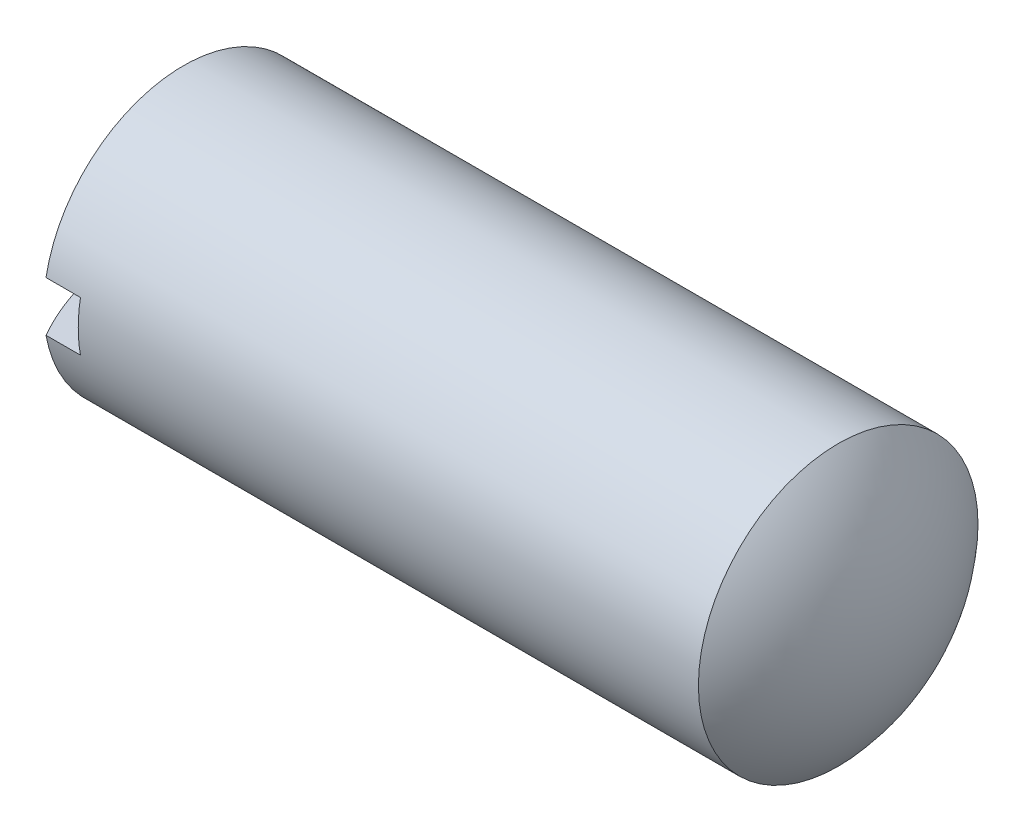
ISO-10303-21;
HEADER;
FILE_DESCRIPTION(('STEP AP214'),'2;1');
FILE_NAME('part.step','',(''),(''),'','','');
FILE_SCHEMA(('AUTOMOTIVE_DESIGN { 1 0 10303 214 1 1 1 1 }'));
ENDSEC;
DATA;
#1=APPLICATION_CONTEXT('core data for automotive mechanical design processes');
#2=APPLICATION_PROTOCOL_DEFINITION('international standard','automotive_design',2000,#1);
#3=PRODUCT_CONTEXT('',#1,'mechanical');
#4=PRODUCT('Part','Part','',(#3));
#5=PRODUCT_RELATED_PRODUCT_CATEGORY('part','',(#4));
#6=PRODUCT_DEFINITION_FORMATION('','',#4);
#7=PRODUCT_DEFINITION_CONTEXT('part definition',#1,'design');
#8=PRODUCT_DEFINITION('design','',#6,#7);
#9=PRODUCT_DEFINITION_SHAPE('','',#8);
#10=(LENGTH_UNIT() NAMED_UNIT(*) SI_UNIT(.MILLI.,.METRE.));
#11=(NAMED_UNIT(*) PLANE_ANGLE_UNIT() SI_UNIT($,.RADIAN.));
#12=(NAMED_UNIT(*) SI_UNIT($,.STERADIAN.) SOLID_ANGLE_UNIT());
#13=UNCERTAINTY_MEASURE_WITH_UNIT(LENGTH_MEASURE(1.E-05),#10,'distance_accuracy_value','');
#14=(GEOMETRIC_REPRESENTATION_CONTEXT(3) GLOBAL_UNCERTAINTY_ASSIGNED_CONTEXT((#13)) GLOBAL_UNIT_ASSIGNED_CONTEXT((#10,
#11,#12)) REPRESENTATION_CONTEXT('',''));
#15=CARTESIAN_POINT('',(0.,0.,0.));
#16=DIRECTION('',(0.,0.,1.));
#17=DIRECTION('',(1.,0.,0.));
#18=AXIS2_PLACEMENT_3D('',#15,#16,#17);
#19=CARTESIAN_POINT('',(19.05,0.,0.));
#20=DIRECTION('',(-1.,0.,0.));
#21=DIRECTION('',(0.,1.,0.));
#22=AXIS2_PLACEMENT_3D('',#19,#20,#21);
#23=SPHERICAL_SURFACE('',#22,19.05);
#24=CARTESIAN_POINT('',(19.05,1.7018,0.));
#25=DIRECTION('',(0.,-1.,0.));
#26=DIRECTION('',(0.,0.,-1.));
#27=AXIS2_PLACEMENT_3D('',#24,#25,#26);
#28=CIRCLE('',#27,18.9738340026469);
#29=CARTESIAN_POINT('',(2.55221605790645,1.7018,9.37173952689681));
#30=VERTEX_POINT('',#29);
#31=CARTESIAN_POINT('',(2.55221605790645,1.7018,-9.37173952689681));
#32=VERTEX_POINT('',#31);
#33=EDGE_CURVE('E94',#30,#32,#28,.T.);
#34=ORIENTED_EDGE('',*,*,#33,.F.);
#35=CARTESIAN_POINT('',(2.55221605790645,0.,0.));
#36=DIRECTION('',(-1.,0.,0.));
#37=DIRECTION('',(0.,0.,1.));
#38=AXIS2_PLACEMENT_3D('',#35,#36,#37);
#39=CIRCLE('',#38,9.525);
#40=EDGE_CURVE('E86',#30,#32,#39,.T.);
#41=ORIENTED_EDGE('',*,*,#40,.T.);
#42=EDGE_LOOP('',(#34,#41));
#43=FACE_BOUND('',#42,.T.);
#44=ADVANCED_FACE('F33',(#43),#23,.T.);
#45=CARTESIAN_POINT('',(19.05,-1.7018,0.));
#46=DIRECTION('',(0.,1.,0.));
#47=DIRECTION('',(0.,0.,1.));
#48=AXIS2_PLACEMENT_3D('',#45,#46,#47);
#49=CIRCLE('',#48,18.9738340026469);
#50=CARTESIAN_POINT('',(2.55221605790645,-1.7018,-9.37173952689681));
#51=VERTEX_POINT('',#50);
#52=CARTESIAN_POINT('',(2.55221605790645,-1.7018,9.37173952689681));
#53=VERTEX_POINT('',#52);
#54=EDGE_CURVE('E106',#51,#53,#49,.T.);
#55=ORIENTED_EDGE('',*,*,#54,.F.);
#56=EDGE_CURVE('E89',#51,#53,#39,.T.);
#57=ORIENTED_EDGE('',*,*,#56,.T.);
#58=EDGE_LOOP('',(#55,#57));
#59=FACE_BOUND('',#58,.T.);
#60=ADVANCED_FACE('F105',(#59),#23,.T.);
#61=CARTESIAN_POINT('',(-12.7,0.,0.));
#62=DIRECTION('',(-1.,0.,0.));
#63=DIRECTION('',(0.,0.,1.));
#64=AXIS2_PLACEMENT_3D('',#61,#62,#63);
#65=CYLINDRICAL_SURFACE('',#64,9.525);
#66=CARTESIAN_POINT('',(47.1574288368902,0.,0.));
#67=DIRECTION('',(-1.,0.,0.));
#68=DIRECTION('',(0.,0.,1.));
#69=AXIS2_PLACEMENT_3D('',#66,#67,#68);
#70=CIRCLE('',#69,9.525);
#71=CARTESIAN_POINT('',(47.1574288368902,0.,9.525));
#72=VERTEX_POINT('',#71);
#73=EDGE_CURVE('E88',#72,#72,#70,.T.);
#74=ORIENTED_EDGE('',*,*,#73,.T.);
#75=EDGE_LOOP('',(#74));
#76=FACE_BOUND('',#75,.T.);
#77=ORIENTED_EDGE('',*,*,#40,.F.);
#78=DIRECTION('',(-1.,0.,0.));
#79=VECTOR('',#78,1.);
#80=CARTESIAN_POINT('',(-12.7,1.7018,9.37173952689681));
#81=LINE('',#80,#79);
#82=CARTESIAN_POINT('',(4.9022,1.7018,9.37173952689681));
#83=VERTEX_POINT('',#82);
#84=EDGE_CURVE('E11',#30,#83,#81,.F.);
#85=ORIENTED_EDGE('',*,*,#84,.T.);
#86=CARTESIAN_POINT('',(4.9022,0.,0.));
#87=DIRECTION('',(1.,0.,0.));
#88=DIRECTION('',(0.,0.,-1.));
#89=AXIS2_PLACEMENT_3D('',#86,#87,#88);
#90=CIRCLE('',#89,9.525);
#91=CARTESIAN_POINT('',(4.9022,-1.7018,9.37173952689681));
#92=VERTEX_POINT('',#91);
#93=EDGE_CURVE('E69',#92,#83,#90,.F.);
#94=ORIENTED_EDGE('',*,*,#93,.F.);
#95=DIRECTION('',(-1.,0.,0.));
#96=VECTOR('',#95,1.);
#97=CARTESIAN_POINT('',(-12.7,-1.7018,9.37173952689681));
#98=LINE('',#97,#96);
#99=EDGE_CURVE('E40',#92,#53,#98,.T.);
#100=ORIENTED_EDGE('',*,*,#99,.T.);
#101=ORIENTED_EDGE('',*,*,#56,.F.);
#102=DIRECTION('',(-1.,0.,0.));
#103=VECTOR('',#102,1.);
#104=CARTESIAN_POINT('',(-12.7,-1.7018,-9.37173952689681));
#105=LINE('',#104,#103);
#106=CARTESIAN_POINT('',(4.9022,-1.7018,-9.37173952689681));
#107=VERTEX_POINT('',#106);
#108=EDGE_CURVE('E98',#51,#107,#105,.F.);
#109=ORIENTED_EDGE('',*,*,#108,.T.);
#110=CARTESIAN_POINT('',(4.9022,1.7018,-9.37173952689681));
#111=VERTEX_POINT('',#110);
#112=EDGE_CURVE('E78',#111,#107,#90,.F.);
#113=ORIENTED_EDGE('',*,*,#112,.F.);
#114=DIRECTION('',(-1.,0.,0.));
#115=VECTOR('',#114,1.);
#116=CARTESIAN_POINT('',(-12.7,1.7018,-9.37173952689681));
#117=LINE('',#116,#115);
#118=EDGE_CURVE('E76',#111,#32,#117,.T.);
#119=ORIENTED_EDGE('',*,*,#118,.T.);
#120=EDGE_LOOP('',(#77,#85,#94,#100,#101,#109,#113,#119));
#121=FACE_BOUND('',#120,.T.);
#122=ADVANCED_FACE('F84',(#76,#121),#65,.T.);
#123=CARTESIAN_POINT('',(36.5252,0.,0.));
#124=DIRECTION('',(-1.,0.,0.));
#125=DIRECTION('',(0.,1.,0.));
#126=AXIS2_PLACEMENT_3D('',#123,#124,#125);
#127=SPHERICAL_SURFACE('',#126,14.2748);
#128=ORIENTED_EDGE('',*,*,#73,.F.);
#129=EDGE_LOOP('',(#128));
#130=FACE_BOUND('',#129,.T.);
#131=ADVANCED_FACE('F116',(#130),#127,.T.);
#132=CARTESIAN_POINT('',(4.9022,1.7018,-9.52499999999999));
#133=DIRECTION('',(0.,-1.,0.));
#134=DIRECTION('',(0.,0.,-1.));
#135=AXIS2_PLACEMENT_3D('',#132,#133,#134);
#136=PLANE('',#135);
#137=ORIENTED_EDGE('',*,*,#33,.T.);
#138=ORIENTED_EDGE('',*,*,#118,.F.);
#139=DIRECTION('',(0.,0.,1.));
#140=VECTOR('',#139,1.);
#141=CARTESIAN_POINT('',(4.9022,1.7018,-9.52499999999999));
#142=LINE('',#141,#140);
#143=EDGE_CURVE('E47',#111,#83,#142,.T.);
#144=ORIENTED_EDGE('',*,*,#143,.T.);
#145=ORIENTED_EDGE('',*,*,#84,.F.);
#146=EDGE_LOOP('',(#137,#138,#144,#145));
#147=FACE_BOUND('',#146,.T.);
#148=ADVANCED_FACE('F79',(#147),#136,.T.);
#149=CARTESIAN_POINT('',(4.9022,-1.7018,-9.52499999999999));
#150=DIRECTION('',(0.,1.,0.));
#151=DIRECTION('',(0.,0.,1.));
#152=AXIS2_PLACEMENT_3D('',#149,#150,#151);
#153=PLANE('',#152);
#154=ORIENTED_EDGE('',*,*,#54,.T.);
#155=ORIENTED_EDGE('',*,*,#99,.F.);
#156=DIRECTION('',(0.,0.,-1.));
#157=VECTOR('',#156,1.);
#158=CARTESIAN_POINT('',(4.9022,-1.7018,-9.52499999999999));
#159=LINE('',#158,#157);
#160=EDGE_CURVE('E72',#92,#107,#159,.T.);
#161=ORIENTED_EDGE('',*,*,#160,.T.);
#162=ORIENTED_EDGE('',*,*,#108,.F.);
#163=EDGE_LOOP('',(#154,#155,#161,#162));
#164=FACE_BOUND('',#163,.T.);
#165=ADVANCED_FACE('F108',(#164),#153,.T.);
#166=CARTESIAN_POINT('',(4.9022,1.7018,-9.52499999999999));
#167=DIRECTION('',(1.,0.,0.));
#168=DIRECTION('',(0.,0.,-1.));
#169=AXIS2_PLACEMENT_3D('',#166,#167,#168);
#170=PLANE('',#169);
#171=ORIENTED_EDGE('',*,*,#160,.F.);
#172=ORIENTED_EDGE('',*,*,#93,.T.);
#173=ORIENTED_EDGE('',*,*,#143,.F.);
#174=ORIENTED_EDGE('',*,*,#112,.T.);
#175=EDGE_LOOP('',(#171,#172,#173,#174));
#176=FACE_BOUND('',#175,.T.);
#177=ADVANCED_FACE('F70',(#176),#170,.F.);
#178=CLOSED_SHELL('',(#44,#60,#122,#131,#148,#165,#177));
#179=MANIFOLD_SOLID_BREP('B2',#178);
#180=ADVANCED_BREP_SHAPE_REPRESENTATION('',(#18,#179),#14);
#181=SHAPE_DEFINITION_REPRESENTATION(#9,#180);
ENDSEC;
END-ISO-10303-21;
